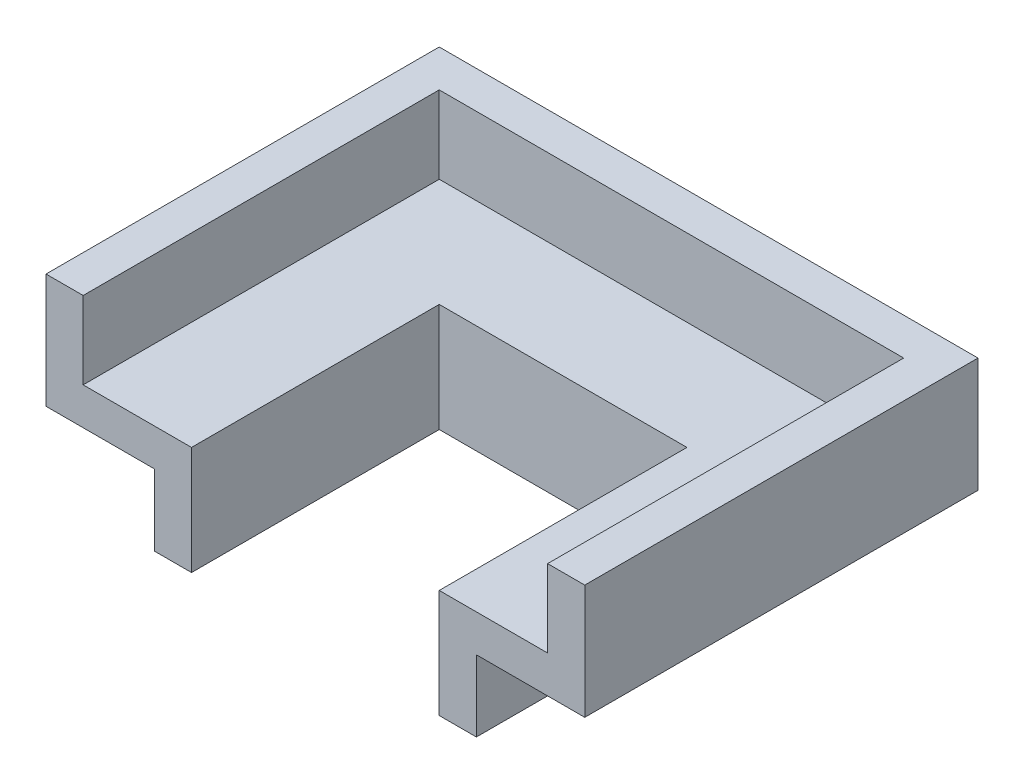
from build123d import *


with BuildPart() as part:
    # Sweep1: sweep along a path in Sketch1
    with BuildLine(Plane(origin=(0, 0, 0), x_dir=(1, 0, 0), z_dir=(0, 1, 0))) as sweep1_path:
        Line((40, 0), (40, 80))
        Line((40, 80), (-40, 80))
        Line((-40, 80), (-40, 0))
    # Sketch2 → Sweep1 (sweep)
    with BuildSketch(Plane.XY):
        Polygon((40, 0), (40, 35), (75, 35), (75, 60), (87, 60), (87, 23), (52, 23), (52, 0), align=None)
    sweep(path=sweep1_path.line, transition=Transition.RIGHT)


solid = part.part
